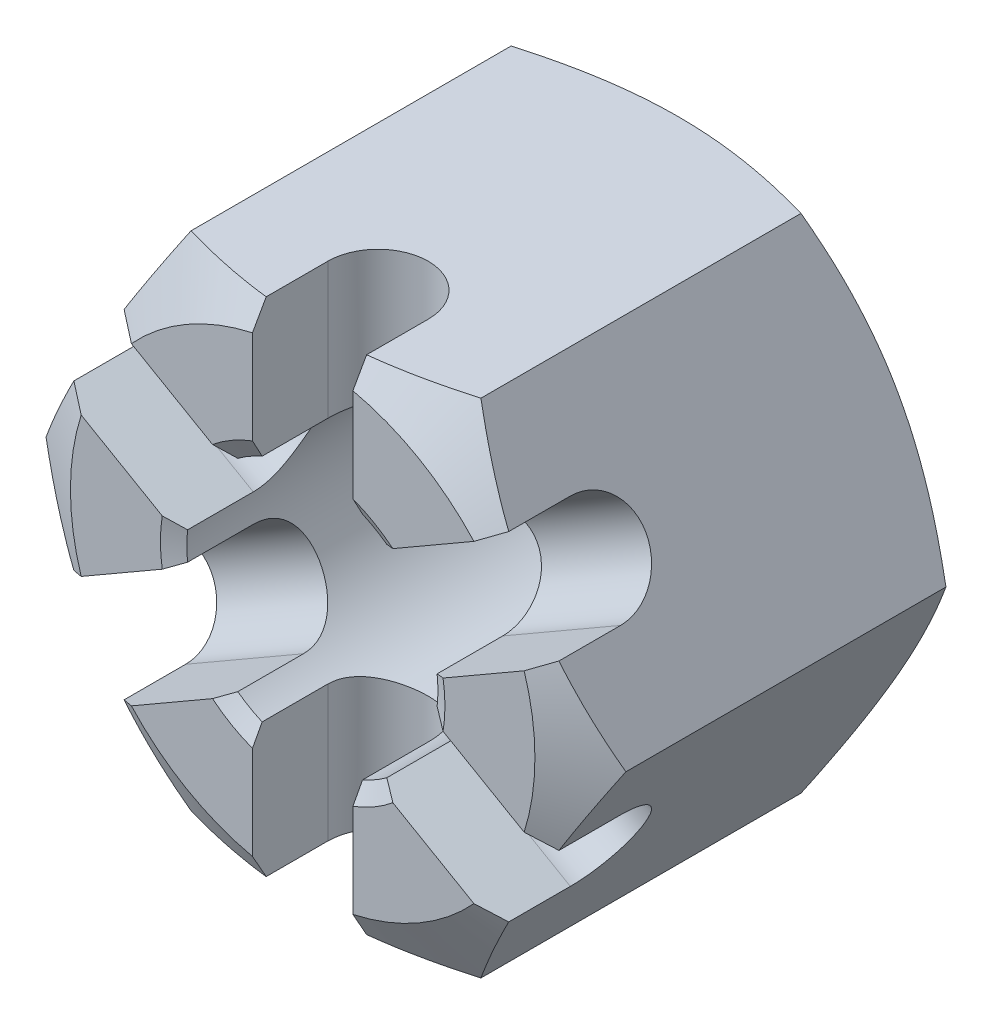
from build123d import *
from OCP.BRepFilletAPI import BRepFilletAPI_MakeChamfer

# Parameters (mm, degrees)
SKETCH1_R         = 2.5
BASENUT_DEPTH     = 7.7
ENDCHAMFER_SIZE   = 0.333333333
ENDCHAMFER_SIZE2  = 0.19245009
SLOT_DEPTH        = 11.845429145
SLOTPATTERN_COUNT = 3


with BuildPart() as part:
    # Sketch1 → BaseNut (new body)
    with BuildSketch(Plane.XY):
        Polygon((2.886751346, -5), (5.773502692, 0), (2.886751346, 5), (-2.886751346, 5), (-5.773502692, 0), (-2.886751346, -5), align=None)
        Circle(SKETCH1_R, mode=Mode.SUBTRACT)
    extrude(amount=-BASENUT_DEPTH)

    # Sketch2 → Double-Chamfer (revolve, cut)
    with BuildSketch(Plane(origin=(0, 0, 0), x_dir=(1, 0, 0), z_dir=(0, 1, 0))):
        Polygon((-5.773502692, 7.7), (-4.625, 7.7), (-5.773502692, 7.036911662), align=None)
        Polygon((-5.773502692, 0.663088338), (-5.773502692, 0), (-4.625, 0), align=None)
    revolve(axis=Axis((0, 0, -3.375940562), (0, 0, 1)), mode=Mode.SUBTRACT)

    # EndChamfer: one chamfer whose edges measure the first distance from different faces: ONE call of the kernel's chamfer builder (chamfer() names one face for all edges)
    endchamfer_edges_1 = [part.edges().sort_by_distance(p)[0] for p in [
        (-2.5, 0, -7.7),
    ]]
    endchamfer_side_1 = [part.faces().sort_by_distance(p)[0] for p in [
        (-2.5, 0, -3.85),
    ]]
    endchamfer_edges_2 = [part.edges().sort_by_distance(p)[0] for p in [
        (-2.5, 0, 0),
    ]]
    endchamfer_side_2 = [part.faces().sort_by_distance(p)[0] for p in [
        (4.494185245, 0, 0),
    ]]
    endchamfer = BRepFilletAPI_MakeChamfer(part.part.solid().wrapped)
    for e in endchamfer_edges_1:
        endchamfer.Add(ENDCHAMFER_SIZE, ENDCHAMFER_SIZE2, e.wrapped, endchamfer_side_1[0].wrapped)  # the first distance lies on this face
    for e in endchamfer_edges_2:
        endchamfer.Add(ENDCHAMFER_SIZE, ENDCHAMFER_SIZE2, e.wrapped, endchamfer_side_2[0].wrapped)  # the first distance lies on this face
    add(Compound.cast(endchamfer.Shape()), mode=Mode.REPLACE)

    # Sketch3 → Slot (cut, symmetric)
    with BuildSketch(Plane(origin=(0, 0, 0), x_dir=(1, 0, 0), z_dir=(0, 1, 0))):
        with BuildLine():
            Line((-1, -30.510518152), (-1, 0))
            Line((-1, 0), (-1, 1.5))
            ThreePointArc((-1, 1.5), (0, 2.5), (1, 1.5))
            Line((1, 1.5), (1, 0))
            Line((1, 0), (1, -30.510518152))
            Line((1, -30.510518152), (1, -91.531554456))
            Line((1, -91.531554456), (-1, -91.531554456))
            Line((-1, -91.531554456), (-1, -30.510518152))
        make_face()
    slot = extrude(amount=SLOT_DEPTH, both=True, mode=Mode.SUBTRACT)

    # SlotPattern: Slot ×3 about axis
    slotpattern_axis = Axis((0, 0, 1.709633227), (0, 0, -1))
    for i in range(1, SLOTPATTERN_COUNT):
        add(slot.rotate(slotpattern_axis, i * 360 / SLOTPATTERN_COUNT), mode=Mode.SUBTRACT)


solid = part.part
